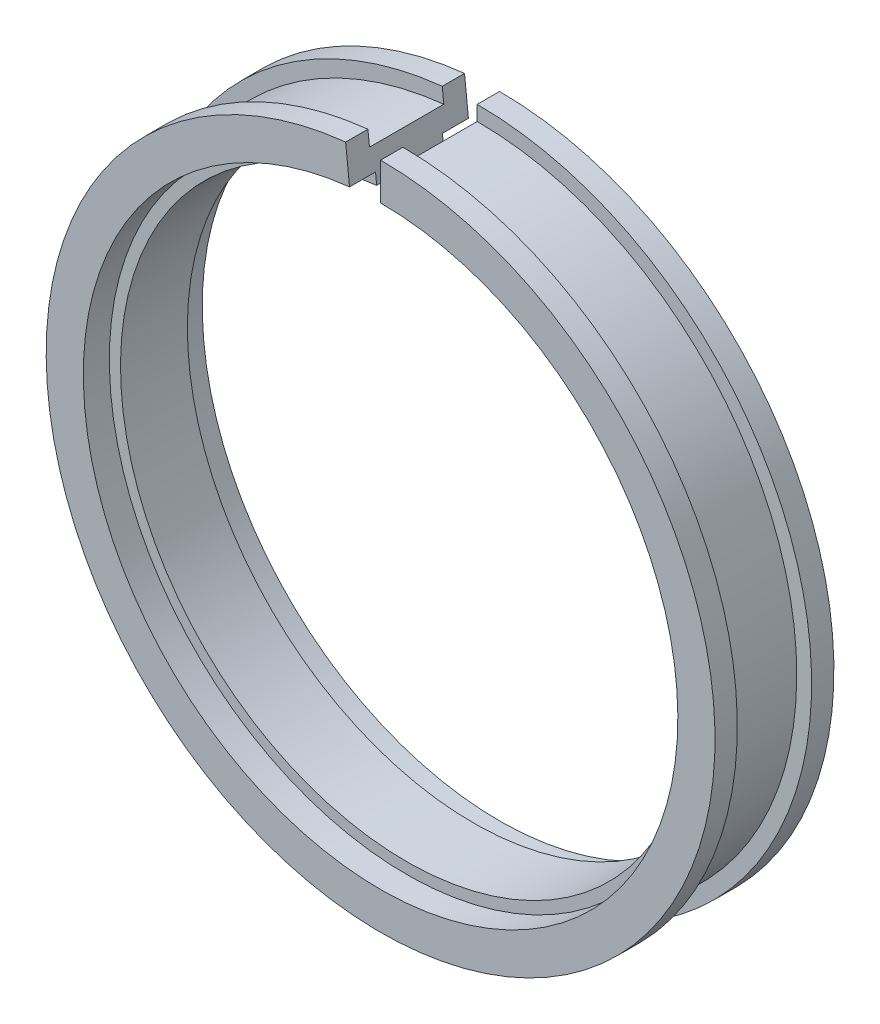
from build123d import *

# Parameters (mm, degrees)
R_VOLUTION1_ANGLE = 354


with BuildPart() as part:
    # Esquisse1 → R_volution1 (revolve)
    with BuildSketch(Plane(origin=(0, 0, 0), x_dir=(0, 0, -1), z_dir=(1, 0, 0))):
        Polygon((0, 40), (0, 45), (3, 45), (3, 43), (13, 43), (13, 45), (16, 45), (16, 40), (12.5, 40), (12.5, 38.5), (3.5, 38.5), (3.5, 40), align=None)
    revolve(axis=Axis((0, 0, 0), (0, 0, -1)), revolution_arc=R_VOLUTION1_ANGLE)


solid = part.part
